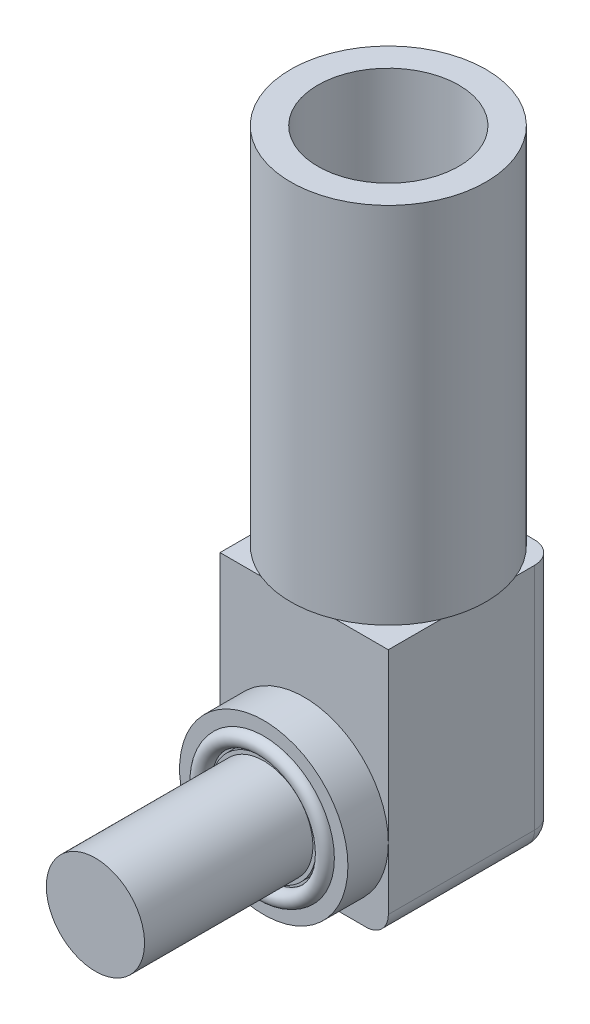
from build123d import *

# Parameters (mm, degrees)
SKETCH1_W          = 19.05
SKETCH1_H          = 19.05
EXTRUDE1_DEPTH     = 28.448
SKETCH3_R          = 7.874
EXTRUDE2_DEPTH     = 3.81
SKETCH4_R          = 1.4605
EXTRUDE3_DEPTH     = 9.652
SKETCH5_R          = 0.9906
EXTRUDE4_DEPTH     = 4.699
CIRPATTERN1_COUNT  = 6
SKETCH_1_R         = 1.4605
EXTRUDE5_DEPTH     = 9.652
SKETCH_2_R         = 0.9906
EXTRUDE6_DEPTH     = 4.699
SKETCH10_R         = 9.525
EXTRUDE8_DEPTH     = 4.572
SKETCH11_R         = 7.9885
SKETCH11_R_2       = 5.9565
CUT_EXTRUDE1_DEPTH = 1.27
SKETCH8_R          = 5.55625
EXTRUDE7_DEPTH     = 19.05
SKETCH9_R          = 0.89
FILLET1_R          = 2.5


with BuildPart() as part:
    # Sketch1 → Extrude1 (new body)
    with BuildSketch(Plane(origin=(0, 0, 0), x_dir=(1, 0, 0), z_dir=(0, 1, 0))):
        Rectangle(SKETCH1_W, SKETCH1_H)
    extrude(amount=EXTRUDE1_DEPTH)

    # Sketch2 → Revolve1 (revolve)
    with BuildSketch(Plane.XY, mode=Mode.PRIVATE) as revolve1_sk:
        Polygon((8.8011, 28.448), (8.8011, 32.2326), (9.398, 32.2326), (9.398, 33.8074), (8.8011, 33.8074), (8.8011, 35.4584), (9.398, 35.4584), (9.398, 37.0332), (8.8011, 37.0332), (8.8011, 37.846), (0, 37.846), (0, 28.448), align=None)
    revolve(revolve1_sk.sketch.rotate(Axis((0, 0, 0), (0, -1, 0)), 180), axis=Axis((0, 0, 0), (0, -1, 0)))

    # Sketch3 → Extrude2 (add)
    with BuildSketch(Plane(origin=(0, 37.846, 0), x_dir=(-1, 0, 0), z_dir=(0, 1, 0))):
        with Locations(Location((0, 0, 0), (0, 0, 180))):
            Circle(SKETCH3_R)
    extrude(amount=EXTRUDE2_DEPTH)

    # Sketch4 → Extrude3 (add)
    with BuildSketch(Plane(origin=(0, 41.656, 0), x_dir=(-1, 0, 0), z_dir=(0, 1, 0))):
        with Locations((0, 4.445)):
            Circle(SKETCH4_R)
    extrude3 = extrude(amount=EXTRUDE3_DEPTH)

    # Sketch5 → Extrude4 (add)
    with BuildSketch(Plane(origin=(0, 51.308, 0), x_dir=(-1, 0, 0), z_dir=(0, 1, 0))):
        with Locations((0, 4.445)):
            Circle(SKETCH5_R)
    extrude4 = extrude(amount=EXTRUDE4_DEPTH)

    # CirPattern1: Extrude3, Extrude4 ×6 about axis, 1 skipped
    cirpattern1_axis = Axis((0, 0, 0), (0, -1, 0))
    add([extrude3.rotate(cirpattern1_axis, i * 360 / CIRPATTERN1_COUNT) for i in range(1, CIRPATTERN1_COUNT) if i not in (3,)])
    add([extrude4.rotate(cirpattern1_axis, i * 360 / CIRPATTERN1_COUNT) for i in range(1, CIRPATTERN1_COUNT) if i not in (3,)])

    # Sketch 1 → Extrude5 (add)
    with BuildSketch(Plane(origin=(0.09953018, 41.656, 4.480198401), x_dir=(-1, 0, 0), z_dir=(0, 1, 0))):
        with Locations((0.09953018, -4.480198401)):
            Circle(SKETCH_1_R)
    extrude(amount=EXTRUDE5_DEPTH)

    # Sketch 2 → Extrude6 (add)
    with BuildSketch(Plane(origin=(0.09953018, 51.308, 4.480198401), x_dir=(-1, 0, 0), z_dir=(0, 1, 0))):
        with Locations(Location((0.09953018, -4.480198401, 0), (0, 0, 180))):
            Circle(SKETCH_2_R)
    extrude(amount=EXTRUDE6_DEPTH)

    # Sketch10 → Extrude8 (add)
    with BuildSketch(Plane.XY.offset(9.525)):
        with Locations((0, 9.525)):
            Circle(SKETCH10_R)
    extrude(amount=EXTRUDE8_DEPTH)

    # Sketch11 → Cut-Extrude1 (cut)
    with BuildSketch(Plane.XY.offset(14.097)):
        with Locations((0, 9.525)):
            Circle(SKETCH11_R)
        with Locations((0, 9.525)):
            Circle(SKETCH11_R_2, mode=Mode.SUBTRACT)
    extrude(amount=-CUT_EXTRUDE1_DEPTH, mode=Mode.SUBTRACT)

    # Sketch8 → Extrude7 (add)
    with BuildSketch(Plane(origin=(0, 12.8, 14.097), x_dir=(1, 0, 0), z_dir=(0, 0, -1))):
        with Locations(Location((0, 3.275, 0), (0, 0, 180))):
            Circle(SKETCH8_R)
    extrude(amount=-EXTRUDE7_DEPTH)

    # Sketch9 → o-ring 12.42x1.78 (revolve)
    with BuildSketch(Plane(origin=(0, -0.125998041, 0.125998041), x_dir=(0, 1, 0), z_dir=(1, 0, 0)), mode=Mode.PRIVATE) as o_ring_12_42x1_78_sk:
        with Locations((16.750998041, 13.971001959)):
            Circle(SKETCH9_R)
    revolve(o_ring_12_42x1_78_sk.sketch.rotate(Axis((0, 9.525, 13.263482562), (0, 0, -1)), 90), axis=Axis((0, 9.525, 13.263482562), (0, 0, -1)))

    # Fillet1
    fillet1_edges = [part.edges().sort_by_distance(p)[0] for p in [
        (0, 0, -9.525),
        (9.525, 0, 0),
        (-9.525, 0, 0),
        (-9.525, 14.224, -9.525),
        (9.525, 14.224, -9.525),
    ]]
    fillet(fillet1_edges, radius=FILLET1_R)


with BuildPart() as body_2:
    # Sketch12 → Locking Sleeve (revolve)
    with BuildSketch(Plane.XY, mode=Mode.PRIVATE) as locking_sleeve_sk:
        Polygon((7.9756, 70.284231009), (7.9756, 38.409581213), (9.755750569, 38.409581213), (9.755750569, 35.384631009), (9.0805, 35.384631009), (9.0805, 33.860631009), (9.755750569, 33.860631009), (9.755750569, 32.209631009), (9.0805, 32.209631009), (9.0805, 29.136231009), (11.049, 29.136231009), (11.049, 70.284231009), align=None)
    revolve(locking_sleeve_sk.sketch.rotate(Axis((0, 0, 0), (0, 1, 0)), 90), axis=Axis((0, 0, 0), (0, 1, 0)))


solid = Compound([part.part, body_2.part])
